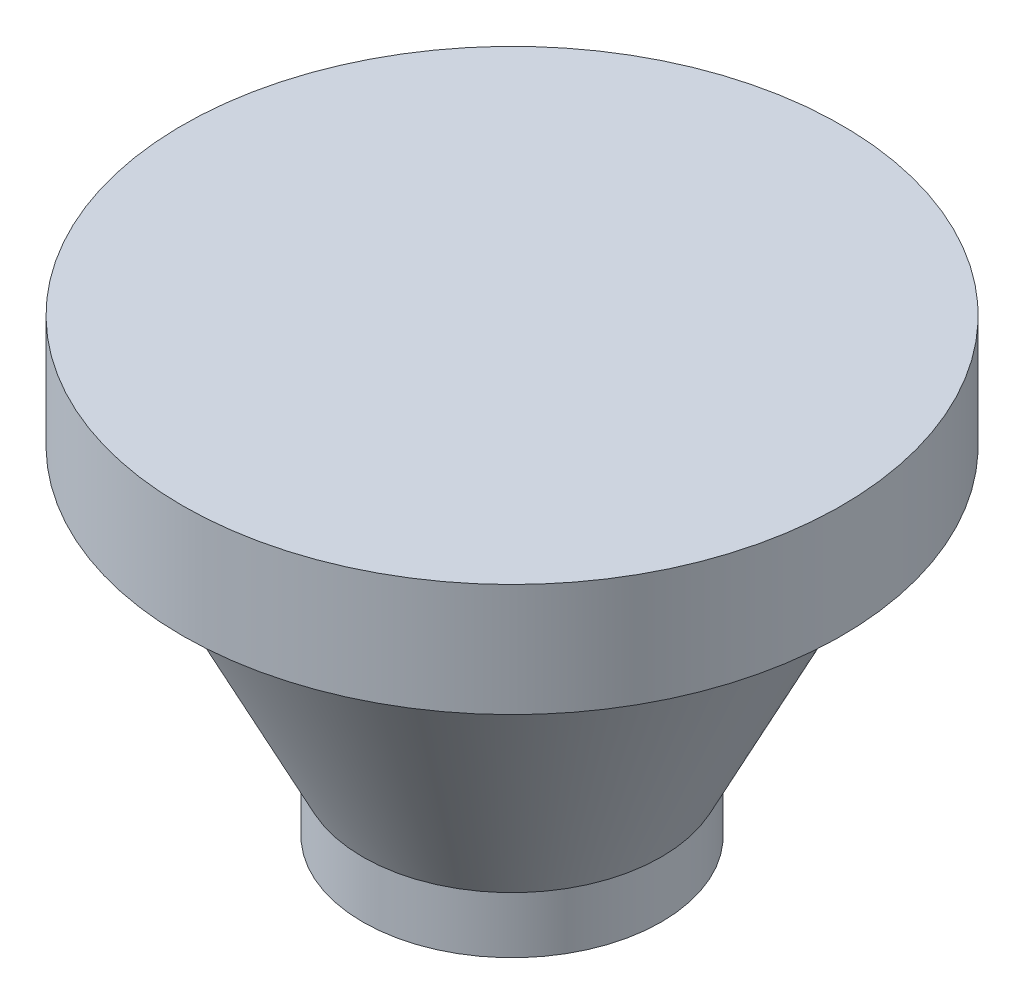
from build123d import *


with BuildPart() as part:
    # Sketch1 → Revolve2 (revolve)
    with BuildSketch(Plane(origin=(0, 0, 0), x_dir=(0, 0, -1), z_dir=(1, 0, 0)), mode=Mode.PRIVATE) as revolve2_sk:
        Polygon((0, 0), (5.3, 0), (5.3, 2), (10.3, 12), (11.7, 12), (11.7, 16), (0, 16), align=None)
    revolve(revolve2_sk.sketch.rotate(Axis((0, 16, 0), (0, -1, 0)), 180), axis=Axis((0, 16, 0), (0, -1, 0)))


solid = part.part
